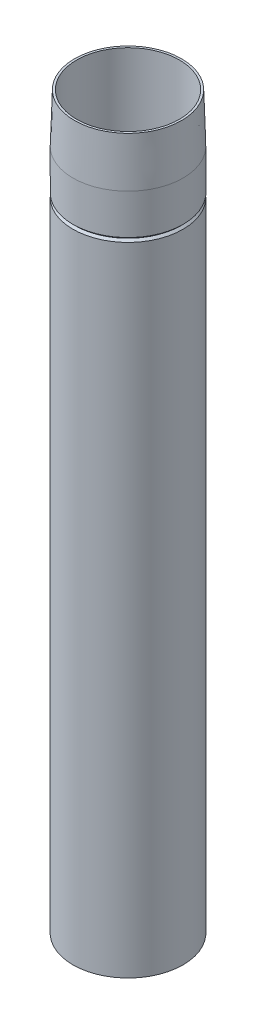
ISO-10303-21;
HEADER;
FILE_DESCRIPTION(('STEP AP214'),'2;1');
FILE_NAME('part.step','',(''),(''),'','','');
FILE_SCHEMA(('AUTOMOTIVE_DESIGN { 1 0 10303 214 1 1 1 1 }'));
ENDSEC;
DATA;
#1=APPLICATION_CONTEXT('core data for automotive mechanical design processes');
#2=APPLICATION_PROTOCOL_DEFINITION('international standard','automotive_design',2000,#1);
#3=PRODUCT_CONTEXT('',#1,'mechanical');
#4=PRODUCT('Part','Part','',(#3));
#5=PRODUCT_RELATED_PRODUCT_CATEGORY('part','',(#4));
#6=PRODUCT_DEFINITION_FORMATION('','',#4);
#7=PRODUCT_DEFINITION_CONTEXT('part definition',#1,'design');
#8=PRODUCT_DEFINITION('design','',#6,#7);
#9=PRODUCT_DEFINITION_SHAPE('','',#8);
#10=(LENGTH_UNIT() NAMED_UNIT(*) SI_UNIT(.MILLI.,.METRE.));
#11=(NAMED_UNIT(*) PLANE_ANGLE_UNIT() SI_UNIT($,.RADIAN.));
#12=(NAMED_UNIT(*) SI_UNIT($,.STERADIAN.) SOLID_ANGLE_UNIT());
#13=UNCERTAINTY_MEASURE_WITH_UNIT(LENGTH_MEASURE(1.E-05),#10,'distance_accuracy_value','');
#14=(GEOMETRIC_REPRESENTATION_CONTEXT(3) GLOBAL_UNCERTAINTY_ASSIGNED_CONTEXT((#13)) GLOBAL_UNIT_ASSIGNED_CONTEXT((#10,
#11,#12)) REPRESENTATION_CONTEXT('',''));
#15=CARTESIAN_POINT('',(0.,0.,0.));
#16=DIRECTION('',(0.,0.,1.));
#17=DIRECTION('',(1.,0.,0.));
#18=AXIS2_PLACEMENT_3D('',#15,#16,#17);
#19=CARTESIAN_POINT('',(0.,400.,0.));
#20=DIRECTION('',(0.,-1.,0.));
#21=DIRECTION('',(0.,0.,-1.));
#22=AXIS2_PLACEMENT_3D('',#19,#20,#21);
#23=CYLINDRICAL_SURFACE('',#22,30.15);
#24=CARTESIAN_POINT('',(0.,373.135840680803,0.));
#25=DIRECTION('',(0.,-1.,0.));
#26=DIRECTION('',(1.,0.,0.));
#27=AXIS2_PLACEMENT_3D('',#24,#25,#26);
#28=CIRCLE('',#27,30.15);
#29=CARTESIAN_POINT('',(30.15,373.135840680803,0.));
#30=VERTEX_POINT('',#29);
#31=EDGE_CURVE('E48',#30,#30,#28,.F.);
#32=ORIENTED_EDGE('',*,*,#31,.F.);
#33=EDGE_LOOP('',(#32));
#34=FACE_BOUND('',#33,.T.);
#35=CARTESIAN_POINT('',(0.,351.15,0.));
#36=DIRECTION('',(0.,1.,0.));
#37=DIRECTION('',(-1.,0.,0.));
#38=AXIS2_PLACEMENT_3D('',#35,#36,#37);
#39=CIRCLE('',#38,30.15);
#40=CARTESIAN_POINT('',(-30.15,351.15,0.));
#41=VERTEX_POINT('',#40);
#42=EDGE_CURVE('E35',#41,#41,#39,.F.);
#43=ORIENTED_EDGE('',*,*,#42,.F.);
#44=EDGE_LOOP('',(#43));
#45=FACE_BOUND('',#44,.T.);
#46=ADVANCED_FACE('F32',(#34,#45),#23,.T.);
#47=CARTESIAN_POINT('',(0.,0.,0.));
#48=DIRECTION('',(0.,1.,0.));
#49=DIRECTION('',(0.,0.,1.));
#50=AXIS2_PLACEMENT_3D('',#47,#48,#49);
#51=CIRCLE('',#50,30.15);
#52=CARTESIAN_POINT('',(0.,0.,30.15));
#53=VERTEX_POINT('',#52);
#54=EDGE_CURVE('E10',#53,#53,#51,.T.);
#55=ORIENTED_EDGE('',*,*,#54,.T.);
#56=EDGE_LOOP('',(#55));
#57=FACE_BOUND('',#56,.T.);
#58=CARTESIAN_POINT('',(0.,348.85,0.));
#59=DIRECTION('',(0.,-1.,0.));
#60=DIRECTION('',(1.,0.,0.));
#61=AXIS2_PLACEMENT_3D('',#58,#59,#60);
#62=CIRCLE('',#61,30.15);
#63=CARTESIAN_POINT('',(30.15,348.85,0.));
#64=VERTEX_POINT('',#63);
#65=EDGE_CURVE('E51',#64,#64,#62,.F.);
#66=ORIENTED_EDGE('',*,*,#65,.F.);
#67=EDGE_LOOP('',(#66));
#68=FACE_BOUND('',#67,.T.);
#69=ADVANCED_FACE('F77',(#57,#68),#23,.T.);
#70=CARTESIAN_POINT('',(0.,400.,0.));
#71=DIRECTION('',(0.,1.,0.));
#72=DIRECTION('',(0.,0.,1.));
#73=AXIS2_PLACEMENT_3D('',#70,#71,#72);
#74=PLANE('',#73);
#75=CARTESIAN_POINT('',(0.,400.,0.));
#76=DIRECTION('',(0.,1.,0.));
#77=DIRECTION('',(0.,0.,1.));
#78=AXIS2_PLACEMENT_3D('',#75,#76,#77);
#79=CIRCLE('',#78,28.15);
#80=CARTESIAN_POINT('',(0.,400.,28.15));
#81=VERTEX_POINT('',#80);
#82=EDGE_CURVE('E39',#81,#81,#79,.T.);
#83=ORIENTED_EDGE('',*,*,#82,.F.);
#84=EDGE_LOOP('',(#83));
#85=FACE_BOUND('',#84,.T.);
#86=CARTESIAN_POINT('',(0.,400.,0.));
#87=DIRECTION('',(0.,1.,0.));
#88=DIRECTION('',(-1.,0.,0.));
#89=AXIS2_PLACEMENT_3D('',#86,#87,#88);
#90=CIRCLE('',#89,29.3105);
#91=CARTESIAN_POINT('',(-29.3105,400.,0.));
#92=VERTEX_POINT('',#91);
#93=EDGE_CURVE('E50',#92,#92,#90,.T.);
#94=ORIENTED_EDGE('',*,*,#93,.T.);
#95=EDGE_LOOP('',(#94));
#96=FACE_BOUND('',#95,.T.);
#97=ADVANCED_FACE('F65',(#85,#96),#74,.T.);
#98=CARTESIAN_POINT('',(0.,0.,0.));
#99=DIRECTION('',(0.,1.,0.));
#100=DIRECTION('',(0.,0.,1.));
#101=AXIS2_PLACEMENT_3D('',#98,#99,#100);
#102=PLANE('',#101);
#103=ORIENTED_EDGE('',*,*,#54,.F.);
#104=EDGE_LOOP('',(#103));
#105=FACE_BOUND('',#104,.T.);
#106=CARTESIAN_POINT('',(0.,0.,0.));
#107=DIRECTION('',(0.,1.,0.));
#108=DIRECTION('',(0.,0.,1.));
#109=AXIS2_PLACEMENT_3D('',#106,#107,#108);
#110=CIRCLE('',#109,28.15);
#111=CARTESIAN_POINT('',(0.,0.,28.15));
#112=VERTEX_POINT('',#111);
#113=EDGE_CURVE('E44',#112,#112,#110,.T.);
#114=ORIENTED_EDGE('',*,*,#113,.T.);
#115=EDGE_LOOP('',(#114));
#116=FACE_BOUND('',#115,.T.);
#117=ADVANCED_FACE('F91',(#105,#116),#102,.F.);
#118=CARTESIAN_POINT('',(0.,400.,0.));
#119=DIRECTION('',(0.,-1.,0.));
#120=DIRECTION('',(0.,0.,-1.));
#121=AXIS2_PLACEMENT_3D('',#118,#119,#120);
#122=CYLINDRICAL_SURFACE('',#121,28.15);
#123=ORIENTED_EDGE('',*,*,#82,.T.);
#124=EDGE_LOOP('',(#123));
#125=FACE_BOUND('',#124,.T.);
#126=ORIENTED_EDGE('',*,*,#113,.F.);
#127=EDGE_LOOP('',(#126));
#128=FACE_BOUND('',#127,.T.);
#129=ADVANCED_FACE('F71',(#125,#128),#122,.F.);
#130=CARTESIAN_POINT('',(0.,400.,0.));
#131=DIRECTION('',(0.,-1.,0.));
#132=DIRECTION('',(1.,0.,0.));
#133=AXIS2_PLACEMENT_3D('',#130,#131,#132);
#134=CONICAL_SURFACE('',#133,29.3105,0.0312396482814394);
#135=ORIENTED_EDGE('',*,*,#93,.F.);
#136=EDGE_LOOP('',(#135));
#137=FACE_BOUND('',#136,.T.);
#138=ORIENTED_EDGE('',*,*,#31,.T.);
#139=EDGE_LOOP('',(#138));
#140=FACE_BOUND('',#139,.T.);
#141=ADVANCED_FACE('F67',(#137,#140),#134,.T.);
#142=CARTESIAN_POINT('',(0.,353.5,0.));
#143=DIRECTION('',(0.,1.,0.));
#144=DIRECTION('',(-1.,0.,0.));
#145=AXIS2_PLACEMENT_3D('',#142,#143,#144);
#146=CONICAL_SURFACE('',#145,32.5,0.785398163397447);
#147=CARTESIAN_POINT('',(0.,350.,0.));
#148=DIRECTION('',(0.,1.,0.));
#149=DIRECTION('',(-1.,0.,0.));
#150=AXIS2_PLACEMENT_3D('',#147,#148,#149);
#151=CIRCLE('',#150,29.);
#152=CARTESIAN_POINT('',(-29.,350.,0.));
#153=VERTEX_POINT('',#152);
#154=EDGE_CURVE('E53',#153,#153,#151,.T.);
#155=ORIENTED_EDGE('',*,*,#154,.T.);
#156=EDGE_LOOP('',(#155));
#157=FACE_BOUND('',#156,.T.);
#158=ORIENTED_EDGE('',*,*,#42,.T.);
#159=EDGE_LOOP('',(#158));
#160=FACE_BOUND('',#159,.T.);
#161=ADVANCED_FACE('F70',(#157,#160),#146,.T.);
#162=CARTESIAN_POINT('',(0.,350.,0.));
#163=DIRECTION('',(0.,-1.,0.));
#164=DIRECTION('',(1.,0.,0.));
#165=AXIS2_PLACEMENT_3D('',#162,#163,#164);
#166=CONICAL_SURFACE('',#165,29.,0.785398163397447);
#167=ORIENTED_EDGE('',*,*,#154,.F.);
#168=EDGE_LOOP('',(#167));
#169=FACE_BOUND('',#168,.T.);
#170=ORIENTED_EDGE('',*,*,#65,.T.);
#171=EDGE_LOOP('',(#170));
#172=FACE_BOUND('',#171,.T.);
#173=ADVANCED_FACE('F81',(#169,#172),#166,.T.);
#174=CLOSED_SHELL('',(#46,#69,#97,#117,#129,#141,#161,#173));
#175=MANIFOLD_SOLID_BREP('B2',#174);
#176=ADVANCED_BREP_SHAPE_REPRESENTATION('',(#18,#175),#14);
#177=SHAPE_DEFINITION_REPRESENTATION(#9,#176);
ENDSEC;
END-ISO-10303-21;
